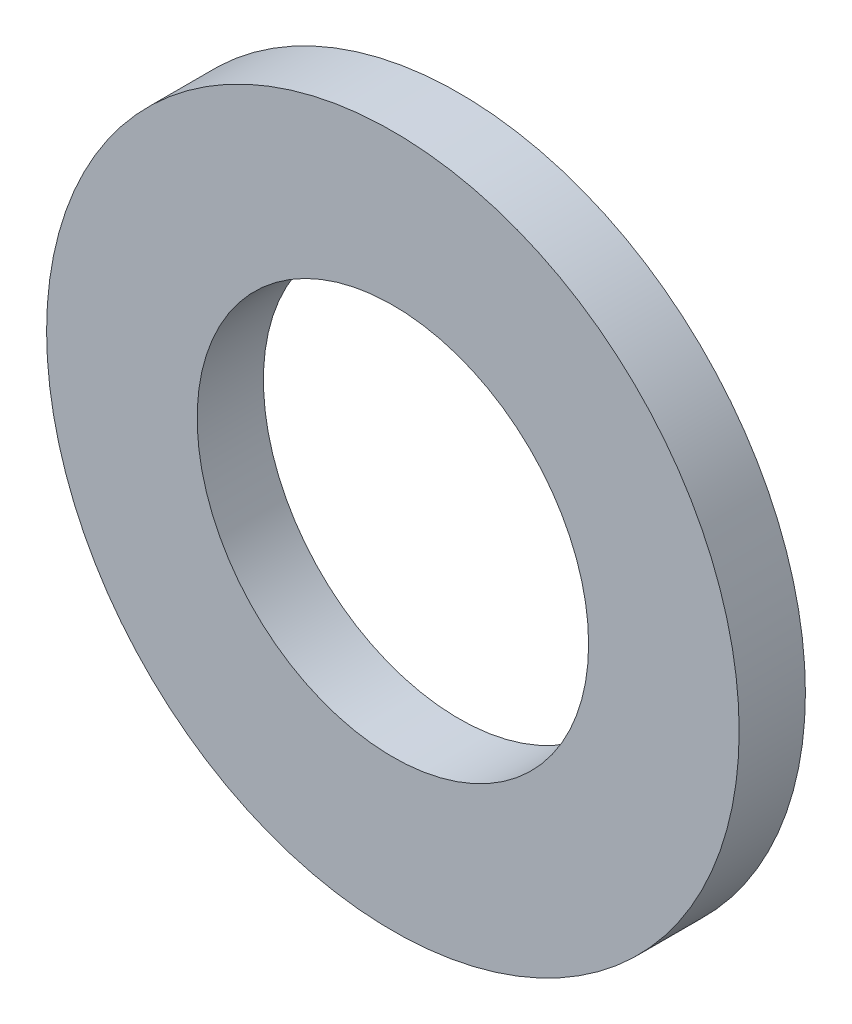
from build123d import *

# Parameters (mm, degrees)
ESQUISSE1_R      = 11.5
ESQUISSE1_R_2    = 6.5
EXTRUSION1_DEPTH = 2.2


with BuildPart() as part:
    # Esquisse1 → Extrusion1 (new body)
    with BuildSketch(Plane.XY):
        Circle(ESQUISSE1_R)
        Circle(ESQUISSE1_R_2, mode=Mode.SUBTRACT)
    extrude(amount=EXTRUSION1_DEPTH)


solid = part.part
